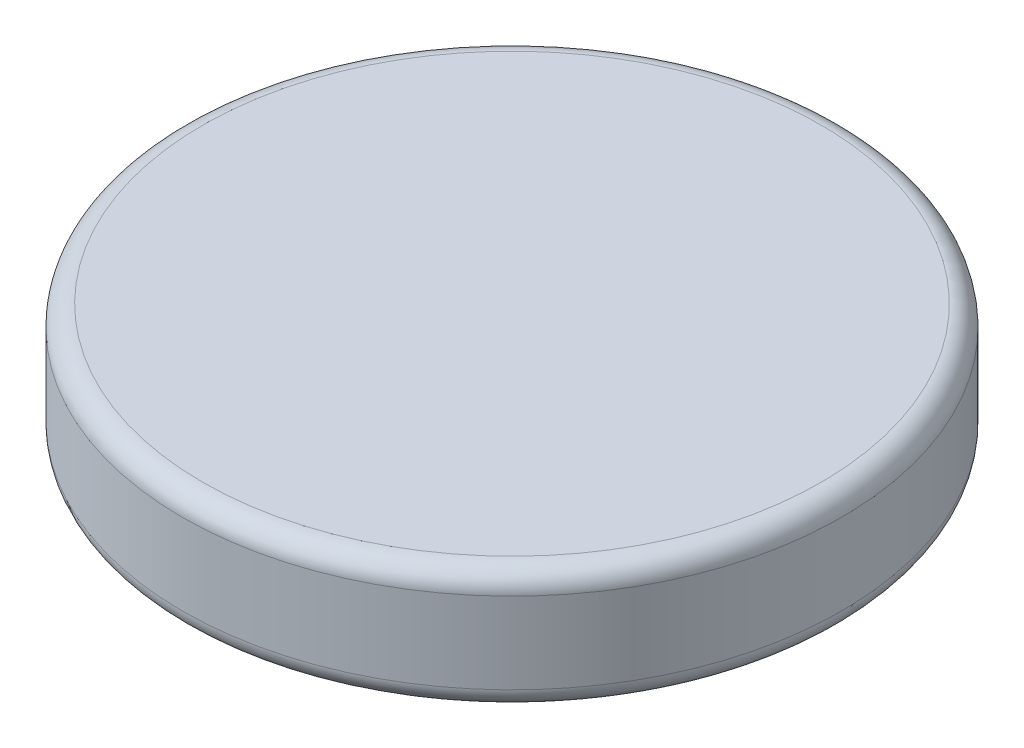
ISO-10303-21;
HEADER;
FILE_DESCRIPTION(('STEP AP214'),'2;1');
FILE_NAME('part.step','',(''),(''),'','','');
FILE_SCHEMA(('AUTOMOTIVE_DESIGN { 1 0 10303 214 1 1 1 1 }'));
ENDSEC;
DATA;
#1=APPLICATION_CONTEXT('core data for automotive mechanical design processes');
#2=APPLICATION_PROTOCOL_DEFINITION('international standard','automotive_design',2000,#1);
#3=PRODUCT_CONTEXT('',#1,'mechanical');
#4=PRODUCT('Part','Part','',(#3));
#5=PRODUCT_RELATED_PRODUCT_CATEGORY('part','',(#4));
#6=PRODUCT_DEFINITION_FORMATION('','',#4);
#7=PRODUCT_DEFINITION_CONTEXT('part definition',#1,'design');
#8=PRODUCT_DEFINITION('design','',#6,#7);
#9=PRODUCT_DEFINITION_SHAPE('','',#8);
#10=(LENGTH_UNIT() NAMED_UNIT(*) SI_UNIT(.MILLI.,.METRE.));
#11=(NAMED_UNIT(*) PLANE_ANGLE_UNIT() SI_UNIT($,.RADIAN.));
#12=(NAMED_UNIT(*) SI_UNIT($,.STERADIAN.) SOLID_ANGLE_UNIT());
#13=UNCERTAINTY_MEASURE_WITH_UNIT(LENGTH_MEASURE(1.E-05),#10,'distance_accuracy_value','');
#14=(GEOMETRIC_REPRESENTATION_CONTEXT(3) GLOBAL_UNCERTAINTY_ASSIGNED_CONTEXT((#13)) GLOBAL_UNIT_ASSIGNED_CONTEXT((#10,
#11,#12)) REPRESENTATION_CONTEXT('',''));
#15=CARTESIAN_POINT('',(0.,0.,0.));
#16=DIRECTION('',(0.,0.,1.));
#17=DIRECTION('',(1.,0.,0.));
#18=AXIS2_PLACEMENT_3D('',#15,#16,#17);
#19=CARTESIAN_POINT('',(0.,12.,0.));
#20=DIRECTION('',(0.,-1.,0.));
#21=DIRECTION('',(0.,0.,-1.));
#22=AXIS2_PLACEMENT_3D('',#19,#20,#21);
#23=CYLINDRICAL_SURFACE('',#22,32.5);
#24=CARTESIAN_POINT('',(0.,10.,0.));
#25=DIRECTION('',(0.,1.,0.));
#26=DIRECTION('',(0.,0.,1.));
#27=AXIS2_PLACEMENT_3D('',#24,#25,#26);
#28=CIRCLE('',#27,32.5);
#29=CARTESIAN_POINT('',(0.,10.,32.5));
#30=VERTEX_POINT('',#29);
#31=EDGE_CURVE('E47',#30,#30,#28,.F.);
#32=ORIENTED_EDGE('',*,*,#31,.T.);
#33=EDGE_LOOP('',(#32));
#34=FACE_BOUND('',#33,.T.);
#35=CARTESIAN_POINT('',(0.,2.,0.));
#36=DIRECTION('',(0.,1.,0.));
#37=DIRECTION('',(0.,0.,1.));
#38=AXIS2_PLACEMENT_3D('',#35,#36,#37);
#39=CIRCLE('',#38,32.5);
#40=CARTESIAN_POINT('',(0.,2.,32.5));
#41=VERTEX_POINT('',#40);
#42=EDGE_CURVE('E52',#41,#41,#39,.T.);
#43=ORIENTED_EDGE('',*,*,#42,.T.);
#44=EDGE_LOOP('',(#43));
#45=FACE_BOUND('',#44,.T.);
#46=ADVANCED_FACE('F39',(#34,#45),#23,.T.);
#47=CARTESIAN_POINT('',(0.,12.,0.));
#48=DIRECTION('',(0.,1.,0.));
#49=DIRECTION('',(0.,0.,1.));
#50=AXIS2_PLACEMENT_3D('',#47,#48,#49);
#51=PLANE('',#50);
#52=CARTESIAN_POINT('',(0.,12.,0.));
#53=DIRECTION('',(0.,1.,0.));
#54=DIRECTION('',(0.,0.,1.));
#55=AXIS2_PLACEMENT_3D('',#52,#53,#54);
#56=CIRCLE('',#55,30.5);
#57=CARTESIAN_POINT('',(0.,12.,30.5));
#58=VERTEX_POINT('',#57);
#59=EDGE_CURVE('E57',#58,#58,#56,.T.);
#60=ORIENTED_EDGE('',*,*,#59,.T.);
#61=EDGE_LOOP('',(#60));
#62=FACE_BOUND('',#61,.T.);
#63=ADVANCED_FACE('F64',(#62),#51,.T.);
#64=CARTESIAN_POINT('',(0.,0.,0.));
#65=DIRECTION('',(0.,1.,0.));
#66=DIRECTION('',(0.,0.,1.));
#67=AXIS2_PLACEMENT_3D('',#64,#65,#66);
#68=PLANE('',#67);
#69=CARTESIAN_POINT('',(0.,0.,0.));
#70=DIRECTION('',(0.,1.,0.));
#71=DIRECTION('',(0.,0.,1.));
#72=AXIS2_PLACEMENT_3D('',#69,#70,#71);
#73=CIRCLE('',#72,30.5);
#74=CARTESIAN_POINT('',(0.,0.,30.5));
#75=VERTEX_POINT('',#74);
#76=EDGE_CURVE('E10',#75,#75,#73,.F.);
#77=ORIENTED_EDGE('',*,*,#76,.T.);
#78=EDGE_LOOP('',(#77));
#79=FACE_BOUND('',#78,.T.);
#80=ADVANCED_FACE('F68',(#79),#68,.F.);
#81=CARTESIAN_POINT('',(0.,10.,0.));
#82=DIRECTION('',(0.,1.,0.));
#83=DIRECTION('',(0.,0.,1.));
#84=AXIS2_PLACEMENT_3D('',#81,#82,#83);
#85=TOROIDAL_SURFACE('',#84,30.5,2.);
#86=ORIENTED_EDGE('',*,*,#31,.F.);
#87=EDGE_LOOP('',(#86));
#88=FACE_BOUND('',#87,.T.);
#89=ORIENTED_EDGE('',*,*,#59,.F.);
#90=EDGE_LOOP('',(#89));
#91=FACE_BOUND('',#90,.T.);
#92=ADVANCED_FACE('F66',(#88,#91),#85,.T.);
#93=CARTESIAN_POINT('',(0.,2.,0.));
#94=DIRECTION('',(0.,1.,0.));
#95=DIRECTION('',(0.,0.,1.));
#96=AXIS2_PLACEMENT_3D('',#93,#94,#95);
#97=TOROIDAL_SURFACE('',#96,30.5,2.);
#98=ORIENTED_EDGE('',*,*,#76,.F.);
#99=EDGE_LOOP('',(#98));
#100=FACE_BOUND('',#99,.T.);
#101=ORIENTED_EDGE('',*,*,#42,.F.);
#102=EDGE_LOOP('',(#101));
#103=FACE_BOUND('',#102,.T.);
#104=ADVANCED_FACE('F41',(#100,#103),#97,.T.);
#105=CLOSED_SHELL('',(#46,#63,#80,#92,#104));
#106=MANIFOLD_SOLID_BREP('B2',#105);
#107=ADVANCED_BREP_SHAPE_REPRESENTATION('',(#18,#106),#14);
#108=SHAPE_DEFINITION_REPRESENTATION(#9,#107);
ENDSEC;
END-ISO-10303-21;
